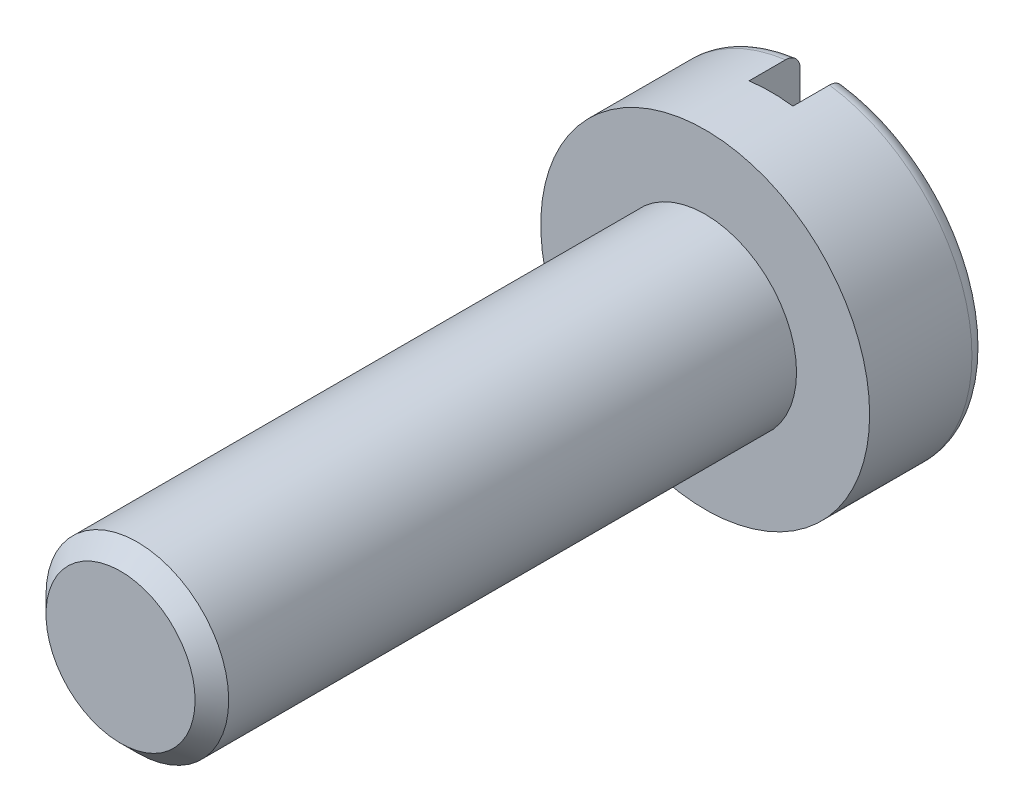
from build123d import *

# Parameters (mm, degrees)
ESQUISSE1_R             = 2.25
BASE_EXTRUSION_DEPTH    = 1.6
ESQUISSE2_R             = 1.25
BOSS_EXTRU_1_DEPTH      = 8
CHANFREIN1_SIZE         = 0.23
CONG_1_R                = 0.2
ESQUISSE3_W             = 0.6
ESQUISSE3_H             = 4.5
ENL_V_MAT_EXTRU_1_DEPTH = 0.7


with BuildPart() as part:
    # Esquisse1 → Base-Extrusion (new body)
    with BuildSketch(Plane.XY):
        Circle(ESQUISSE1_R)
    extrude(amount=-BASE_EXTRUSION_DEPTH)

    # Esquisse2 → Boss.-Extru.1 (add)
    with BuildSketch(Plane.XY):
        Circle(ESQUISSE2_R)
    extrude(amount=BOSS_EXTRU_1_DEPTH)

    # Chanfrein1
    chanfrein1_edges = [part.edges().sort_by_distance(p)[0] for p in [
        (-1.25, 0, 8),
    ]]
    chamfer(chanfrein1_edges, length=CHANFREIN1_SIZE)

    # Cong_1
    cong_1_edges = [part.edges().sort_by_distance(p)[0] for p in [
        (-2.25, 0, -1.6),
    ]]
    fillet(cong_1_edges, radius=CONG_1_R)

    # Esquisse3 → Enl_v. mat.-Extru.1 (cut)
    with BuildSketch(Plane(origin=(0, 0, -1.6), x_dir=(-1, 0, 0), z_dir=(0, 0, -1))):
        Rectangle(ESQUISSE3_W, ESQUISSE3_H)
    extrude(amount=-ENL_V_MAT_EXTRU_1_DEPTH, mode=Mode.SUBTRACT)


solid = part.part
